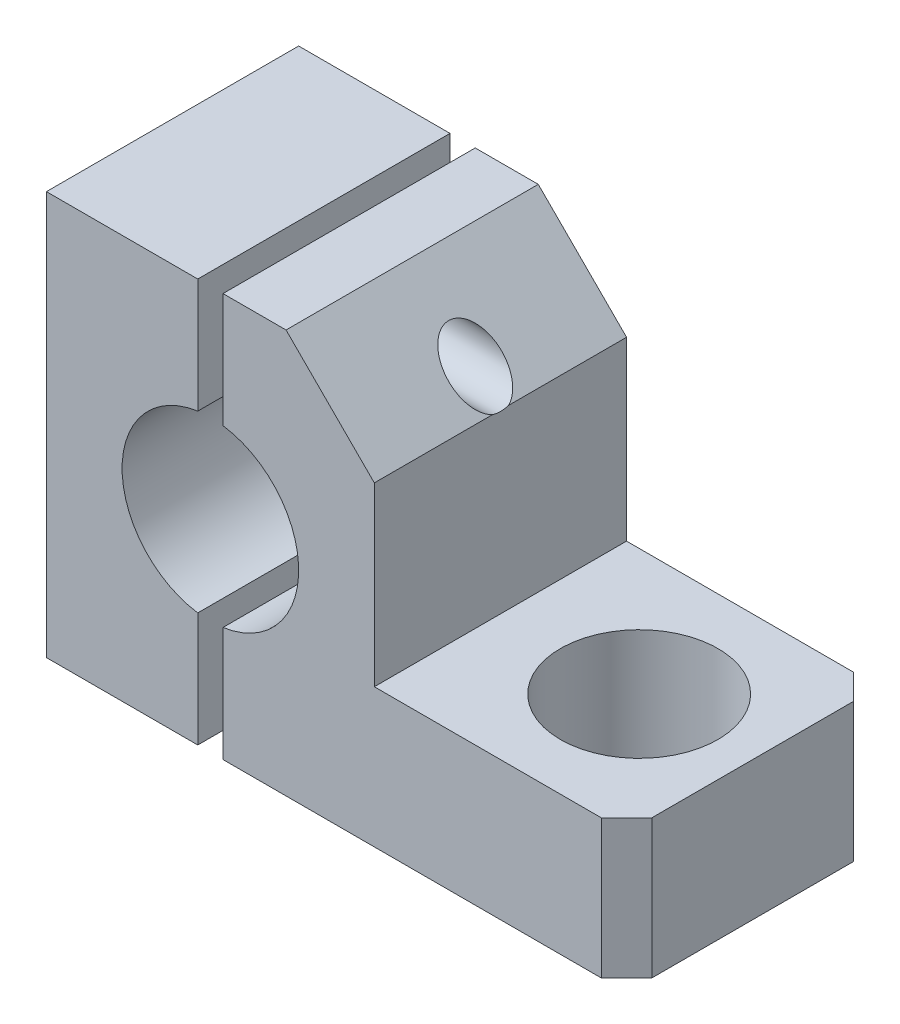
ISO-10303-21;
HEADER;
FILE_DESCRIPTION(('STEP AP214'),'2;1');
FILE_NAME('part.step','',(''),(''),'','','');
FILE_SCHEMA(('AUTOMOTIVE_DESIGN { 1 0 10303 214 1 1 1 1 }'));
ENDSEC;
DATA;
#1=APPLICATION_CONTEXT('core data for automotive mechanical design processes');
#2=APPLICATION_PROTOCOL_DEFINITION('international standard','automotive_design',2000,#1);
#3=PRODUCT_CONTEXT('',#1,'mechanical');
#4=PRODUCT('Part','Part','',(#3));
#5=PRODUCT_RELATED_PRODUCT_CATEGORY('part','',(#4));
#6=PRODUCT_DEFINITION_FORMATION('','',#4);
#7=PRODUCT_DEFINITION_CONTEXT('part definition',#1,'design');
#8=PRODUCT_DEFINITION('design','',#6,#7);
#9=PRODUCT_DEFINITION_SHAPE('','',#8);
#10=(LENGTH_UNIT() NAMED_UNIT(*) SI_UNIT(.MILLI.,.METRE.));
#11=(NAMED_UNIT(*) PLANE_ANGLE_UNIT() SI_UNIT($,.RADIAN.));
#12=(NAMED_UNIT(*) SI_UNIT($,.STERADIAN.) SOLID_ANGLE_UNIT());
#13=UNCERTAINTY_MEASURE_WITH_UNIT(LENGTH_MEASURE(1.E-05),#10,'distance_accuracy_value','');
#14=(GEOMETRIC_REPRESENTATION_CONTEXT(3) GLOBAL_UNCERTAINTY_ASSIGNED_CONTEXT((#13)) GLOBAL_UNIT_ASSIGNED_CONTEXT((#10,
#11,#12)) REPRESENTATION_CONTEXT('',''));
#15=CARTESIAN_POINT('',(0.,0.,0.));
#16=DIRECTION('',(0.,0.,1.));
#17=DIRECTION('',(1.,0.,0.));
#18=AXIS2_PLACEMENT_3D('',#15,#16,#17);
#19=CARTESIAN_POINT('',(15.0000000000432,-11.,0.));
#20=DIRECTION('',(-1.,0.,0.));
#21=DIRECTION('',(0.,0.,1.));
#22=AXIS2_PLACEMENT_3D('',#19,#20,#21);
#23=CONICAL_SURFACE('',#22,2.09999999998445,1.04719755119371);
#24=CARTESIAN_POINT('',(16.2124355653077,-11.,0.));
#25=VERTEX_POINT('',#24);
#26=VERTEX_LOOP('',#25);
#27=FACE_BOUND('',#26,.T.);
#28=CARTESIAN_POINT('',(15.,-11.,0.));
#29=DIRECTION('',(-1.,0.,0.));
#30=DIRECTION('',(0.,0.,1.));
#31=AXIS2_PLACEMENT_3D('',#28,#29,#30);
#32=CIRCLE('',#31,2.09999999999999);
#33=CARTESIAN_POINT('',(15.,-11.,2.09999999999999));
#34=VERTEX_POINT('',#33);
#35=EDGE_CURVE('P0_E121',#34,#34,#32,.T.);
#36=ORIENTED_EDGE('',*,*,#35,.T.);
#37=EDGE_LOOP('',(#36));
#38=FACE_BOUND('',#37,.T.);
#39=ADVANCED_FACE('P0_F16',(#27,#38),#23,.F.);
#40=CARTESIAN_POINT('',(1.,11.,0.));
#41=DIRECTION('',(-1.,0.,0.));
#42=DIRECTION('',(0.,0.,1.));
#43=AXIS2_PLACEMENT_3D('',#40,#41,#42);
#44=CYLINDRICAL_SURFACE('',#43,2.09999999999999);
#45=CARTESIAN_POINT('',(0.999999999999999,11.,0.));
#46=DIRECTION('',(-1.,0.,0.));
#47=DIRECTION('',(0.,0.,1.));
#48=AXIS2_PLACEMENT_3D('',#45,#46,#47);
#49=CIRCLE('',#48,2.09999999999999);
#50=CARTESIAN_POINT('',(0.999999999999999,11.,2.09999999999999));
#51=VERTEX_POINT('',#50);
#52=EDGE_CURVE('P0_E141',#51,#51,#49,.T.);
#53=ORIENTED_EDGE('',*,*,#52,.T.);
#54=EDGE_LOOP('',(#53));
#55=FACE_BOUND('',#54,.T.);
#56=CARTESIAN_POINT('',(11.,11.,0.));
#57=DIRECTION('',(-0.707106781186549,-0.707106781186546,0.));
#58=DIRECTION('',(-0.707106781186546,0.707106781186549,0.));
#59=AXIS2_PLACEMENT_3D('',#56,#57,#58);
#60=ELLIPSE('',#59,2.96984848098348,2.09999999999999);
#61=CARTESIAN_POINT('',(13.,8.99999999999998,-0.640312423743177));
#62=VERTEX_POINT('',#61);
#63=CARTESIAN_POINT('',(13.,8.99999999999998,0.640312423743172));
#64=VERTEX_POINT('',#63);
#65=EDGE_CURVE('P0_E105',#62,#64,#60,.F.);
#66=ORIENTED_EDGE('',*,*,#65,.T.);
#67=CARTESIAN_POINT('',(13.,11.,0.));
#68=DIRECTION('',(-1.,0.,0.));
#69=DIRECTION('',(0.,0.,1.));
#70=AXIS2_PLACEMENT_3D('',#67,#68,#69);
#71=CIRCLE('',#70,2.09999999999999);
#72=EDGE_CURVE('P0_E19',#62,#64,#71,.T.);
#73=ORIENTED_EDGE('',*,*,#72,.F.);
#74=EDGE_LOOP('',(#66,#73));
#75=FACE_BOUND('',#74,.T.);
#76=ADVANCED_FACE('P0_F106',(#55,#75),#44,.F.);
#77=CARTESIAN_POINT('',(1.,-11.,0.));
#78=DIRECTION('',(-1.,0.,0.));
#79=DIRECTION('',(0.,0.,1.));
#80=AXIS2_PLACEMENT_3D('',#77,#78,#79);
#81=CYLINDRICAL_SURFACE('',#80,2.09999999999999);
#82=ORIENTED_EDGE('',*,*,#35,.F.);
#83=EDGE_LOOP('',(#82));
#84=FACE_BOUND('',#83,.T.);
#85=CARTESIAN_POINT('',(1.,-11.,0.));
#86=DIRECTION('',(-1.,0.,0.));
#87=DIRECTION('',(0.,0.,1.));
#88=AXIS2_PLACEMENT_3D('',#85,#86,#87);
#89=CIRCLE('',#88,2.09999999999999);
#90=CARTESIAN_POINT('',(1.,-11.,2.09999999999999));
#91=VERTEX_POINT('',#90);
#92=EDGE_CURVE('P0_E155',#91,#91,#89,.T.);
#93=ORIENTED_EDGE('',*,*,#92,.T.);
#94=EDGE_LOOP('',(#93));
#95=FACE_BOUND('',#94,.T.);
#96=ADVANCED_FACE('P0_F351',(#84,#95),#81,.F.);
#97=CARTESIAN_POINT('',(13.,-5.,10.));
#98=DIRECTION('',(0.,-1.,0.));
#99=DIRECTION('',(0.,0.,-1.));
#100=AXIS2_PLACEMENT_3D('',#97,#98,#99);
#101=PLANE('',#100);
#102=DIRECTION('',(-0.707106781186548,0.,-0.707106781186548));
#103=VECTOR('',#102,1.);
#104=CARTESIAN_POINT('',(33.,-5.,-8.));
#105=LINE('',#104,#103);
#106=CARTESIAN_POINT('',(31.,-5.,-10.));
#107=VERTEX_POINT('',#106);
#108=CARTESIAN_POINT('',(33.,-5.,-7.99999999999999));
#109=VERTEX_POINT('',#108);
#110=EDGE_CURVE('P0_E431',#107,#109,#105,.F.);
#111=ORIENTED_EDGE('',*,*,#110,.F.);
#112=DIRECTION('',(-1.,0.,0.));
#113=VECTOR('',#112,1.);
#114=CARTESIAN_POINT('',(-13.,-5.,-10.));
#115=LINE('',#114,#113);
#116=CARTESIAN_POINT('',(13.,-5.,-10.));
#117=VERTEX_POINT('',#116);
#118=EDGE_CURVE('P0_E434',#117,#107,#115,.F.);
#119=ORIENTED_EDGE('',*,*,#118,.F.);
#120=DIRECTION('',(0.,0.,1.));
#121=VECTOR('',#120,1.);
#122=CARTESIAN_POINT('',(13.,-5.,10.));
#123=LINE('',#122,#121);
#124=CARTESIAN_POINT('',(13.,-5.,10.));
#125=VERTEX_POINT('',#124);
#126=EDGE_CURVE('P0_E111',#117,#125,#123,.T.);
#127=ORIENTED_EDGE('',*,*,#126,.T.);
#128=DIRECTION('',(-1.,0.,0.));
#129=VECTOR('',#128,1.);
#130=CARTESIAN_POINT('',(-13.,-5.,10.));
#131=LINE('',#130,#129);
#132=CARTESIAN_POINT('',(31.,-5.,10.));
#133=VERTEX_POINT('',#132);
#134=EDGE_CURVE('P0_E186',#125,#133,#131,.F.);
#135=ORIENTED_EDGE('',*,*,#134,.T.);
#136=DIRECTION('',(-0.707106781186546,0.,0.707106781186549));
#137=VECTOR('',#136,1.);
#138=CARTESIAN_POINT('',(31.,-5.,10.));
#139=LINE('',#138,#137);
#140=CARTESIAN_POINT('',(33.,-5.,8.));
#141=VERTEX_POINT('',#140);
#142=EDGE_CURVE('P0_E453',#133,#141,#139,.F.);
#143=ORIENTED_EDGE('',*,*,#142,.T.);
#144=DIRECTION('',(0.,0.,1.));
#145=VECTOR('',#144,1.);
#146=CARTESIAN_POINT('',(33.,-5.,10.));
#147=LINE('',#146,#145);
#148=EDGE_CURVE('P0_E436',#141,#109,#147,.F.);
#149=ORIENTED_EDGE('',*,*,#148,.T.);
#150=EDGE_LOOP('',(#111,#119,#127,#135,#143,#149));
#151=FACE_BOUND('',#150,.T.);
#152=CARTESIAN_POINT('',(24.,-5.,0.));
#153=DIRECTION('',(0.,1.,0.));
#154=DIRECTION('',(0.,0.,1.));
#155=AXIS2_PLACEMENT_3D('',#152,#153,#154);
#156=CIRCLE('',#155,6.25);
#157=CARTESIAN_POINT('',(24.,-5.,6.25));
#158=VERTEX_POINT('',#157);
#159=EDGE_CURVE('P0_E127',#158,#158,#156,.F.);
#160=ORIENTED_EDGE('',*,*,#159,.T.);
#161=EDGE_LOOP('',(#160));
#162=FACE_BOUND('',#161,.T.);
#163=ADVANCED_FACE('P0_F222',(#151,#162),#101,.F.);
#164=CARTESIAN_POINT('',(0.,0.,10.));
#165=DIRECTION('',(0.,0.,-1.));
#166=DIRECTION('',(-1.,0.,0.));
#167=AXIS2_PLACEMENT_3D('',#164,#165,#166);
#168=CYLINDRICAL_SURFACE('',#167,7.);
#169=CARTESIAN_POINT('',(0.,0.,10.));
#170=DIRECTION('',(0.,0.,-1.));
#171=DIRECTION('',(-1.,0.,0.));
#172=AXIS2_PLACEMENT_3D('',#169,#170,#171);
#173=CIRCLE('',#172,7.);
#174=CARTESIAN_POINT('',(1.,-6.92820323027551,10.));
#175=VERTEX_POINT('',#174);
#176=CARTESIAN_POINT('',(1.,6.92820323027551,10.));
#177=VERTEX_POINT('',#176);
#178=EDGE_CURVE('P0_E199',#175,#177,#173,.F.);
#179=ORIENTED_EDGE('',*,*,#178,.T.);
#180=DIRECTION('',(0.,0.,1.));
#181=VECTOR('',#180,1.);
#182=CARTESIAN_POINT('',(1.,6.92820323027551,-25.));
#183=LINE('',#182,#181);
#184=CARTESIAN_POINT('',(1.,6.92820323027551,-10.));
#185=VERTEX_POINT('',#184);
#186=EDGE_CURVE('P0_E138',#177,#185,#183,.F.);
#187=ORIENTED_EDGE('',*,*,#186,.T.);
#188=CARTESIAN_POINT('',(0.,0.,-10.));
#189=DIRECTION('',(0.,0.,-1.));
#190=DIRECTION('',(-1.,0.,0.));
#191=AXIS2_PLACEMENT_3D('',#188,#189,#190);
#192=CIRCLE('',#191,7.);
#193=CARTESIAN_POINT('',(1.,-6.92820323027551,-10.));
#194=VERTEX_POINT('',#193);
#195=EDGE_CURVE('P0_E196',#194,#185,#192,.F.);
#196=ORIENTED_EDGE('',*,*,#195,.F.);
#197=DIRECTION('',(0.,0.,1.));
#198=VECTOR('',#197,1.);
#199=CARTESIAN_POINT('',(1.,-6.92820323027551,-25.));
#200=LINE('',#199,#198);
#201=EDGE_CURVE('P0_E152',#194,#175,#200,.T.);
#202=ORIENTED_EDGE('',*,*,#201,.T.);
#203=EDGE_LOOP('',(#179,#187,#196,#202));
#204=FACE_BOUND('',#203,.T.);
#205=ADVANCED_FACE('P0_F212',(#204),#168,.F.);
#206=CARTESIAN_POINT('',(1.,16.,-25.));
#207=DIRECTION('',(1.,0.,0.));
#208=DIRECTION('',(0.,1.,0.));
#209=AXIS2_PLACEMENT_3D('',#206,#207,#208);
#210=PLANE('',#209);
#211=DIRECTION('',(0.,1.,0.));
#212=VECTOR('',#211,1.);
#213=CARTESIAN_POINT('',(1.,16.,-10.));
#214=LINE('',#213,#212);
#215=CARTESIAN_POINT('',(1.,16.,-10.));
#216=VERTEX_POINT('',#215);
#217=EDGE_CURVE('P0_E149',#185,#216,#214,.T.);
#218=ORIENTED_EDGE('',*,*,#217,.F.);
#219=ORIENTED_EDGE('',*,*,#186,.F.);
#220=DIRECTION('',(0.,1.,0.));
#221=VECTOR('',#220,1.);
#222=CARTESIAN_POINT('',(1.,16.,10.));
#223=LINE('',#222,#221);
#224=CARTESIAN_POINT('',(1.,16.,10.));
#225=VERTEX_POINT('',#224);
#226=EDGE_CURVE('P0_E168',#177,#225,#223,.T.);
#227=ORIENTED_EDGE('',*,*,#226,.T.);
#228=DIRECTION('',(0.,0.,-1.));
#229=VECTOR('',#228,1.);
#230=CARTESIAN_POINT('',(1.,16.,10.));
#231=LINE('',#230,#229);
#232=EDGE_CURVE('P0_E137',#225,#216,#231,.T.);
#233=ORIENTED_EDGE('',*,*,#232,.T.);
#234=EDGE_LOOP('',(#218,#219,#227,#233));
#235=FACE_BOUND('',#234,.T.);
#236=ORIENTED_EDGE('',*,*,#52,.F.);
#237=EDGE_LOOP('',(#236));
#238=FACE_BOUND('',#237,.T.);
#239=ADVANCED_FACE('P0_F209',(#235,#238),#210,.F.);
#240=CARTESIAN_POINT('',(-13.,16.,10.));
#241=DIRECTION('',(0.,-1.,0.));
#242=DIRECTION('',(0.,0.,-1.));
#243=AXIS2_PLACEMENT_3D('',#240,#241,#242);
#244=PLANE('',#243);
#245=DIRECTION('',(0.,0.,1.));
#246=VECTOR('',#245,1.);
#247=CARTESIAN_POINT('',(6.00000000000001,16.,10.));
#248=LINE('',#247,#246);
#249=CARTESIAN_POINT('',(6.00000000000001,16.,10.));
#250=VERTEX_POINT('',#249);
#251=CARTESIAN_POINT('',(6.00000000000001,16.,-10.));
#252=VERTEX_POINT('',#251);
#253=EDGE_CURVE('P0_E112',#250,#252,#248,.F.);
#254=ORIENTED_EDGE('',*,*,#253,.T.);
#255=DIRECTION('',(-1.,0.,0.));
#256=VECTOR('',#255,1.);
#257=CARTESIAN_POINT('',(-13.,16.,-10.));
#258=LINE('',#257,#256);
#259=EDGE_CURVE('P0_E146',#216,#252,#258,.F.);
#260=ORIENTED_EDGE('',*,*,#259,.F.);
#261=ORIENTED_EDGE('',*,*,#232,.F.);
#262=DIRECTION('',(-1.,0.,0.));
#263=VECTOR('',#262,1.);
#264=CARTESIAN_POINT('',(-13.,16.,10.));
#265=LINE('',#264,#263);
#266=EDGE_CURVE('P0_E165',#225,#250,#265,.F.);
#267=ORIENTED_EDGE('',*,*,#266,.T.);
#268=EDGE_LOOP('',(#254,#260,#261,#267));
#269=FACE_BOUND('',#268,.T.);
#270=ADVANCED_FACE('P0_F211',(#269),#244,.F.);
#271=CARTESIAN_POINT('',(6.00000000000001,16.,10.));
#272=DIRECTION('',(-0.707106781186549,-0.707106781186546,0.));
#273=DIRECTION('',(0.707106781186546,-0.707106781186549,0.));
#274=AXIS2_PLACEMENT_3D('',#271,#272,#273);
#275=PLANE('',#274);
#276=DIRECTION('',(0.,0.,1.));
#277=VECTOR('',#276,1.);
#278=CARTESIAN_POINT('',(13.,8.99999999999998,10.));
#279=LINE('',#278,#277);
#280=CARTESIAN_POINT('',(13.,8.99999999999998,-10.));
#281=VERTEX_POINT('',#280);
#282=EDGE_CURVE('P0_E120',#62,#281,#279,.F.);
#283=ORIENTED_EDGE('',*,*,#282,.T.);
#284=DIRECTION('',(0.707106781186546,-0.707106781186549,0.));
#285=VECTOR('',#284,1.);
#286=CARTESIAN_POINT('',(6.00000000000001,16.,-10.));
#287=LINE('',#286,#285);
#288=EDGE_CURVE('P0_E148',#252,#281,#287,.T.);
#289=ORIENTED_EDGE('',*,*,#288,.F.);
#290=ORIENTED_EDGE('',*,*,#253,.F.);
#291=DIRECTION('',(0.707106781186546,-0.707106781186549,0.));
#292=VECTOR('',#291,1.);
#293=CARTESIAN_POINT('',(6.00000000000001,16.,10.));
#294=LINE('',#293,#292);
#295=CARTESIAN_POINT('',(13.,8.99999999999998,10.));
#296=VERTEX_POINT('',#295);
#297=EDGE_CURVE('P0_E125',#250,#296,#294,.T.);
#298=ORIENTED_EDGE('',*,*,#297,.T.);
#299=DIRECTION('',(0.,0.,1.));
#300=VECTOR('',#299,1.);
#301=CARTESIAN_POINT('',(13.,8.99999999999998,10.));
#302=LINE('',#301,#300);
#303=EDGE_CURVE('P0_E117',#296,#64,#302,.F.);
#304=ORIENTED_EDGE('',*,*,#303,.T.);
#305=ORIENTED_EDGE('',*,*,#65,.F.);
#306=EDGE_LOOP('',(#283,#289,#290,#298,#304,#305));
#307=FACE_BOUND('',#306,.T.);
#308=ADVANCED_FACE('P0_F123',(#307),#275,.F.);
#309=CARTESIAN_POINT('',(13.,16.,10.));
#310=DIRECTION('',(-1.,0.,0.));
#311=DIRECTION('',(0.,-1.,0.));
#312=AXIS2_PLACEMENT_3D('',#309,#310,#311);
#313=PLANE('',#312);
#314=ORIENTED_EDGE('',*,*,#72,.T.);
#315=ORIENTED_EDGE('',*,*,#303,.F.);
#316=DIRECTION('',(0.,1.,0.));
#317=VECTOR('',#316,1.);
#318=CARTESIAN_POINT('',(13.,16.,10.));
#319=LINE('',#318,#317);
#320=EDGE_CURVE('P0_E184',#296,#125,#319,.F.);
#321=ORIENTED_EDGE('',*,*,#320,.T.);
#322=ORIENTED_EDGE('',*,*,#126,.F.);
#323=DIRECTION('',(0.,1.,0.));
#324=VECTOR('',#323,1.);
#325=CARTESIAN_POINT('',(13.,16.,-10.));
#326=LINE('',#325,#324);
#327=EDGE_CURVE('P0_E177',#281,#117,#326,.F.);
#328=ORIENTED_EDGE('',*,*,#327,.F.);
#329=ORIENTED_EDGE('',*,*,#282,.F.);
#330=EDGE_LOOP('',(#314,#315,#321,#322,#328,#329));
#331=FACE_BOUND('',#330,.T.);
#332=ADVANCED_FACE('P0_F115',(#331),#313,.F.);
#333=CARTESIAN_POINT('',(24.,-16.,0.));
#334=DIRECTION('',(0.,1.,0.));
#335=DIRECTION('',(0.,0.,1.));
#336=AXIS2_PLACEMENT_3D('',#333,#334,#335);
#337=CYLINDRICAL_SURFACE('',#336,6.25);
#338=CARTESIAN_POINT('',(24.,-16.,0.));
#339=DIRECTION('',(0.,1.,0.));
#340=DIRECTION('',(0.,0.,1.));
#341=AXIS2_PLACEMENT_3D('',#338,#339,#340);
#342=CIRCLE('',#341,6.25);
#343=CARTESIAN_POINT('',(24.,-16.,6.25));
#344=VERTEX_POINT('',#343);
#345=EDGE_CURVE('P0_E160',#344,#344,#342,.F.);
#346=ORIENTED_EDGE('',*,*,#345,.T.);
#347=EDGE_LOOP('',(#346));
#348=FACE_BOUND('',#347,.T.);
#349=ORIENTED_EDGE('',*,*,#159,.F.);
#350=EDGE_LOOP('',(#349));
#351=FACE_BOUND('',#350,.T.);
#352=ADVANCED_FACE('P0_F257',(#348,#351),#337,.F.);
#353=CARTESIAN_POINT('',(1.,16.,-25.));
#354=DIRECTION('',(1.,0.,0.));
#355=DIRECTION('',(0.,1.,0.));
#356=AXIS2_PLACEMENT_3D('',#353,#354,#355);
#357=PLANE('',#356);
#358=DIRECTION('',(0.,1.,0.));
#359=VECTOR('',#358,1.);
#360=CARTESIAN_POINT('',(1.,16.,-10.));
#361=LINE('',#360,#359);
#362=CARTESIAN_POINT('',(1.,-16.,-10.));
#363=VERTEX_POINT('',#362);
#364=EDGE_CURVE('P0_E198',#363,#194,#361,.T.);
#365=ORIENTED_EDGE('',*,*,#364,.F.);
#366=DIRECTION('',(0.,0.,1.));
#367=VECTOR('',#366,1.);
#368=CARTESIAN_POINT('',(1.,-16.,10.));
#369=LINE('',#368,#367);
#370=CARTESIAN_POINT('',(1.,-16.,10.));
#371=VERTEX_POINT('',#370);
#372=EDGE_CURVE('P0_E156',#363,#371,#369,.T.);
#373=ORIENTED_EDGE('',*,*,#372,.T.);
#374=DIRECTION('',(0.,1.,0.));
#375=VECTOR('',#374,1.);
#376=CARTESIAN_POINT('',(1.,16.,10.));
#377=LINE('',#376,#375);
#378=EDGE_CURVE('P0_E154',#371,#175,#377,.T.);
#379=ORIENTED_EDGE('',*,*,#378,.T.);
#380=ORIENTED_EDGE('',*,*,#201,.F.);
#381=EDGE_LOOP('',(#365,#373,#379,#380));
#382=FACE_BOUND('',#381,.T.);
#383=ORIENTED_EDGE('',*,*,#92,.F.);
#384=EDGE_LOOP('',(#383));
#385=FACE_BOUND('',#384,.T.);
#386=ADVANCED_FACE('P0_F253',(#382,#385),#357,.F.);
#387=CARTESIAN_POINT('',(-13.,16.,10.));
#388=DIRECTION('',(0.,0.,-1.));
#389=DIRECTION('',(-1.,0.,0.));
#390=AXIS2_PLACEMENT_3D('',#387,#388,#389);
#391=PLANE('',#390);
#392=DIRECTION('',(0.,1.,0.));
#393=VECTOR('',#392,1.);
#394=CARTESIAN_POINT('',(31.,16.,10.));
#395=LINE('',#394,#393);
#396=CARTESIAN_POINT('',(31.,-16.,10.));
#397=VERTEX_POINT('',#396);
#398=EDGE_CURVE('P0_E455',#397,#133,#395,.T.);
#399=ORIENTED_EDGE('',*,*,#398,.T.);
#400=ORIENTED_EDGE('',*,*,#134,.F.);
#401=ORIENTED_EDGE('',*,*,#320,.F.);
#402=ORIENTED_EDGE('',*,*,#297,.F.);
#403=ORIENTED_EDGE('',*,*,#266,.F.);
#404=ORIENTED_EDGE('',*,*,#226,.F.);
#405=ORIENTED_EDGE('',*,*,#178,.F.);
#406=ORIENTED_EDGE('',*,*,#378,.F.);
#407=DIRECTION('',(-1.,0.,0.));
#408=VECTOR('',#407,1.);
#409=CARTESIAN_POINT('',(33.,-16.,10.));
#410=LINE('',#409,#408);
#411=EDGE_CURVE('P0_E159',#371,#397,#410,.F.);
#412=ORIENTED_EDGE('',*,*,#411,.T.);
#413=EDGE_LOOP('',(#399,#400,#401,#402,#403,#404,#405,#406,#412));
#414=FACE_BOUND('',#413,.T.);
#415=ADVANCED_FACE('P0_F249',(#414),#391,.F.);
#416=CARTESIAN_POINT('',(31.,16.,10.));
#417=DIRECTION('',(-0.707106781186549,0.,-0.707106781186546));
#418=DIRECTION('',(-0.707106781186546,0.,0.707106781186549));
#419=AXIS2_PLACEMENT_3D('',#416,#417,#418);
#420=PLANE('',#419);
#421=DIRECTION('',(0.,1.,0.));
#422=VECTOR('',#421,1.);
#423=CARTESIAN_POINT('',(33.,-5.,8.));
#424=LINE('',#423,#422);
#425=CARTESIAN_POINT('',(33.,-16.,8.));
#426=VERTEX_POINT('',#425);
#427=EDGE_CURVE('P0_E450',#426,#141,#424,.T.);
#428=ORIENTED_EDGE('',*,*,#427,.T.);
#429=ORIENTED_EDGE('',*,*,#142,.F.);
#430=ORIENTED_EDGE('',*,*,#398,.F.);
#431=DIRECTION('',(0.707106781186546,0.,-0.707106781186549));
#432=VECTOR('',#431,1.);
#433=CARTESIAN_POINT('',(31.,-16.,10.));
#434=LINE('',#433,#432);
#435=EDGE_CURVE('P0_E173',#397,#426,#434,.T.);
#436=ORIENTED_EDGE('',*,*,#435,.T.);
#437=EDGE_LOOP('',(#428,#429,#430,#436));
#438=FACE_BOUND('',#437,.T.);
#439=ADVANCED_FACE('P0_F245',(#438),#420,.F.);
#440=CARTESIAN_POINT('',(33.,-5.,10.));
#441=DIRECTION('',(-1.,0.,0.));
#442=DIRECTION('',(0.,0.,1.));
#443=AXIS2_PLACEMENT_3D('',#440,#441,#442);
#444=PLANE('',#443);
#445=DIRECTION('',(0.,1.,0.));
#446=VECTOR('',#445,1.);
#447=CARTESIAN_POINT('',(33.,-5.,-8.));
#448=LINE('',#447,#446);
#449=CARTESIAN_POINT('',(33.,-16.,-8.));
#450=VERTEX_POINT('',#449);
#451=EDGE_CURVE('P0_E438',#109,#450,#448,.F.);
#452=ORIENTED_EDGE('',*,*,#451,.F.);
#453=ORIENTED_EDGE('',*,*,#148,.F.);
#454=ORIENTED_EDGE('',*,*,#427,.F.);
#455=DIRECTION('',(0.,0.,1.));
#456=VECTOR('',#455,1.);
#457=CARTESIAN_POINT('',(33.,-16.,10.));
#458=LINE('',#457,#456);
#459=EDGE_CURVE('P0_E474',#426,#450,#458,.F.);
#460=ORIENTED_EDGE('',*,*,#459,.T.);
#461=EDGE_LOOP('',(#452,#453,#454,#460));
#462=FACE_BOUND('',#461,.T.);
#463=ADVANCED_FACE('P0_F241',(#462),#444,.F.);
#464=CARTESIAN_POINT('',(33.,-5.,-8.));
#465=DIRECTION('',(0.707106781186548,0.,-0.707106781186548));
#466=DIRECTION('',(-0.707106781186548,0.,-0.707106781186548));
#467=AXIS2_PLACEMENT_3D('',#464,#465,#466);
#468=PLANE('',#467);
#469=ORIENTED_EDGE('',*,*,#110,.T.);
#470=ORIENTED_EDGE('',*,*,#451,.T.);
#471=DIRECTION('',(-0.707106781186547,0.,-0.707106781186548));
#472=VECTOR('',#471,1.);
#473=CARTESIAN_POINT('',(33.,-16.,-7.99999999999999));
#474=LINE('',#473,#472);
#475=CARTESIAN_POINT('',(31.,-16.,-10.));
#476=VERTEX_POINT('',#475);
#477=EDGE_CURVE('P0_E25',#450,#476,#474,.T.);
#478=ORIENTED_EDGE('',*,*,#477,.T.);
#479=DIRECTION('',(0.,1.,0.));
#480=VECTOR('',#479,1.);
#481=CARTESIAN_POINT('',(31.,16.,-10.));
#482=LINE('',#481,#480);
#483=EDGE_CURVE('P0_E33',#107,#476,#482,.F.);
#484=ORIENTED_EDGE('',*,*,#483,.F.);
#485=EDGE_LOOP('',(#469,#470,#478,#484));
#486=FACE_BOUND('',#485,.T.);
#487=ADVANCED_FACE('P0_F234',(#486),#468,.T.);
#488=CARTESIAN_POINT('',(-13.,16.,-10.));
#489=DIRECTION('',(0.,0.,-1.));
#490=DIRECTION('',(-1.,0.,0.));
#491=AXIS2_PLACEMENT_3D('',#488,#489,#490);
#492=PLANE('',#491);
#493=ORIENTED_EDGE('',*,*,#288,.T.);
#494=ORIENTED_EDGE('',*,*,#327,.T.);
#495=ORIENTED_EDGE('',*,*,#118,.T.);
#496=ORIENTED_EDGE('',*,*,#483,.T.);
#497=DIRECTION('',(-1.,0.,0.));
#498=VECTOR('',#497,1.);
#499=CARTESIAN_POINT('',(33.,-16.,-10.));
#500=LINE('',#499,#498);
#501=EDGE_CURVE('P0_E11',#476,#363,#500,.T.);
#502=ORIENTED_EDGE('',*,*,#501,.T.);
#503=ORIENTED_EDGE('',*,*,#364,.T.);
#504=ORIENTED_EDGE('',*,*,#195,.T.);
#505=ORIENTED_EDGE('',*,*,#217,.T.);
#506=ORIENTED_EDGE('',*,*,#259,.T.);
#507=EDGE_LOOP('',(#493,#494,#495,#496,#502,#503,#504,#505,#506));
#508=FACE_BOUND('',#507,.T.);
#509=ADVANCED_FACE('P0_F228',(#508),#492,.T.);
#510=CARTESIAN_POINT('',(33.,-16.,10.));
#511=DIRECTION('',(0.,1.,0.));
#512=DIRECTION('',(-1.,0.,0.));
#513=AXIS2_PLACEMENT_3D('',#510,#511,#512);
#514=PLANE('',#513);
#515=ORIENTED_EDGE('',*,*,#477,.F.);
#516=ORIENTED_EDGE('',*,*,#459,.F.);
#517=ORIENTED_EDGE('',*,*,#435,.F.);
#518=ORIENTED_EDGE('',*,*,#411,.F.);
#519=ORIENTED_EDGE('',*,*,#372,.F.);
#520=ORIENTED_EDGE('',*,*,#501,.F.);
#521=EDGE_LOOP('',(#515,#516,#517,#518,#519,#520));
#522=FACE_BOUND('',#521,.T.);
#523=ORIENTED_EDGE('',*,*,#345,.F.);
#524=EDGE_LOOP('',(#523));
#525=FACE_BOUND('',#524,.T.);
#526=ADVANCED_FACE('P0_F226',(#522,#525),#514,.F.);
#527=CLOSED_SHELL('',(#39,#76,#96,#163,#205,#239,#270,#308,#332,#352,#386,#415,#439,#463,#487,
#509,#526));
#528=MANIFOLD_SOLID_BREP('P0_B1',#527);
#529=CARTESIAN_POINT('',(-0.999999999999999,16.,-25.));
#530=DIRECTION('',(-1.,0.,0.));
#531=DIRECTION('',(0.,-1.,0.));
#532=AXIS2_PLACEMENT_3D('',#529,#530,#531);
#533=PLANE('',#532);
#534=DIRECTION('',(0.,1.,0.));
#535=VECTOR('',#534,1.);
#536=CARTESIAN_POINT('',(-0.999999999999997,16.,-10.));
#537=LINE('',#536,#535);
#538=CARTESIAN_POINT('',(-0.999999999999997,-6.92820323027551,-10.));
#539=VERTEX_POINT('',#538);
#540=CARTESIAN_POINT('',(-0.999999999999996,-16.,-10.));
#541=VERTEX_POINT('',#540);
#542=EDGE_CURVE('P1_E124',#539,#541,#537,.F.);
#543=ORIENTED_EDGE('',*,*,#542,.F.);
#544=DIRECTION('',(0.,0.,-1.));
#545=VECTOR('',#544,1.);
#546=CARTESIAN_POINT('',(-0.999999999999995,-6.92820323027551,10.));
#547=LINE('',#546,#545);
#548=CARTESIAN_POINT('',(-0.999999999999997,-6.92820323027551,10.));
#549=VERTEX_POINT('',#548);
#550=EDGE_CURVE('P1_E64',#539,#549,#547,.F.);
#551=ORIENTED_EDGE('',*,*,#550,.T.);
#552=DIRECTION('',(0.,1.,0.));
#553=VECTOR('',#552,1.);
#554=CARTESIAN_POINT('',(-0.999999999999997,16.,10.));
#555=LINE('',#554,#553);
#556=CARTESIAN_POINT('',(-0.999999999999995,-16.,10.));
#557=VERTEX_POINT('',#556);
#558=EDGE_CURVE('P1_E77',#549,#557,#555,.F.);
#559=ORIENTED_EDGE('',*,*,#558,.T.);
#560=DIRECTION('',(0.,0.,1.));
#561=VECTOR('',#560,1.);
#562=CARTESIAN_POINT('',(-0.999999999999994,-16.,10.));
#563=LINE('',#562,#561);
#564=EDGE_CURVE('P1_E121',#557,#541,#563,.F.);
#565=ORIENTED_EDGE('',*,*,#564,.T.);
#566=EDGE_LOOP('',(#543,#551,#559,#565));
#567=FACE_BOUND('',#566,.T.);
#568=CARTESIAN_POINT('',(-0.999999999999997,-11.,0.));
#569=DIRECTION('',(-1.,0.,0.));
#570=DIRECTION('',(0.,0.,1.));
#571=AXIS2_PLACEMENT_3D('',#568,#569,#570);
#572=CIRCLE('',#571,2.75);
#573=CARTESIAN_POINT('',(-0.999999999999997,-11.,2.75));
#574=VERTEX_POINT('',#573);
#575=EDGE_CURVE('P1_E19',#574,#574,#572,.T.);
#576=ORIENTED_EDGE('',*,*,#575,.T.);
#577=EDGE_LOOP('',(#576));
#578=FACE_BOUND('',#577,.T.);
#579=ADVANCED_FACE('P1_F16',(#567,#578),#533,.F.);
#580=CARTESIAN_POINT('',(-0.999999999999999,16.,-25.));
#581=DIRECTION('',(-1.,0.,0.));
#582=DIRECTION('',(0.,-1.,0.));
#583=AXIS2_PLACEMENT_3D('',#580,#581,#582);
#584=PLANE('',#583);
#585=DIRECTION('',(0.,1.,0.));
#586=VECTOR('',#585,1.);
#587=CARTESIAN_POINT('',(-0.999999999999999,16.,-10.));
#588=LINE('',#587,#586);
#589=CARTESIAN_POINT('',(-0.999999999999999,16.,-10.));
#590=VERTEX_POINT('',#589);
#591=CARTESIAN_POINT('',(-0.999999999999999,6.92820323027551,-10.));
#592=VERTEX_POINT('',#591);
#593=EDGE_CURVE('P1_E105',#590,#592,#588,.F.);
#594=ORIENTED_EDGE('',*,*,#593,.F.);
#595=DIRECTION('',(0.,0.,-1.));
#596=VECTOR('',#595,1.);
#597=CARTESIAN_POINT('',(-0.999999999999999,16.,10.));
#598=LINE('',#597,#596);
#599=CARTESIAN_POINT('',(-0.999999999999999,16.,10.));
#600=VERTEX_POINT('',#599);
#601=EDGE_CURVE('P1_E91',#590,#600,#598,.F.);
#602=ORIENTED_EDGE('',*,*,#601,.T.);
#603=DIRECTION('',(0.,1.,0.));
#604=VECTOR('',#603,1.);
#605=CARTESIAN_POINT('',(-0.999999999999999,16.,10.));
#606=LINE('',#605,#604);
#607=CARTESIAN_POINT('',(-0.999999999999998,6.92820323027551,10.));
#608=VERTEX_POINT('',#607);
#609=EDGE_CURVE('P1_E74',#600,#608,#606,.F.);
#610=ORIENTED_EDGE('',*,*,#609,.T.);
#611=DIRECTION('',(0.,0.,-1.));
#612=VECTOR('',#611,1.);
#613=CARTESIAN_POINT('',(-0.999999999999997,6.92820323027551,10.));
#614=LINE('',#613,#612);
#615=EDGE_CURVE('P1_E81',#608,#592,#614,.T.);
#616=ORIENTED_EDGE('',*,*,#615,.T.);
#617=EDGE_LOOP('',(#594,#602,#610,#616));
#618=FACE_BOUND('',#617,.T.);
#619=CARTESIAN_POINT('',(-0.999999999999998,11.,0.));
#620=DIRECTION('',(-1.,0.,0.));
#621=DIRECTION('',(0.,0.,1.));
#622=AXIS2_PLACEMENT_3D('',#619,#620,#621);
#623=CIRCLE('',#622,2.75);
#624=CARTESIAN_POINT('',(-0.999999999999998,11.,2.75));
#625=VERTEX_POINT('',#624);
#626=EDGE_CURVE('P1_E109',#625,#625,#623,.T.);
#627=ORIENTED_EDGE('',*,*,#626,.T.);
#628=EDGE_LOOP('',(#627));
#629=FACE_BOUND('',#628,.T.);
#630=ADVANCED_FACE('P1_F89',(#618,#629),#584,.F.);
#631=CARTESIAN_POINT('',(0.,0.,10.));
#632=DIRECTION('',(0.,0.,-1.));
#633=DIRECTION('',(-1.,0.,0.));
#634=AXIS2_PLACEMENT_3D('',#631,#632,#633);
#635=CYLINDRICAL_SURFACE('',#634,7.);
#636=CARTESIAN_POINT('',(0.,0.,10.));
#637=DIRECTION('',(0.,0.,-1.));
#638=DIRECTION('',(-1.,0.,0.));
#639=AXIS2_PLACEMENT_3D('',#636,#637,#638);
#640=CIRCLE('',#639,7.);
#641=EDGE_CURVE('P1_E70',#608,#549,#640,.F.);
#642=ORIENTED_EDGE('',*,*,#641,.T.);
#643=ORIENTED_EDGE('',*,*,#550,.F.);
#644=CARTESIAN_POINT('',(0.,0.,-10.));
#645=DIRECTION('',(0.,0.,-1.));
#646=DIRECTION('',(-1.,0.,0.));
#647=AXIS2_PLACEMENT_3D('',#644,#645,#646);
#648=CIRCLE('',#647,7.);
#649=EDGE_CURVE('P1_E84',#592,#539,#648,.F.);
#650=ORIENTED_EDGE('',*,*,#649,.F.);
#651=ORIENTED_EDGE('',*,*,#615,.F.);
#652=EDGE_LOOP('',(#642,#643,#650,#651));
#653=FACE_BOUND('',#652,.T.);
#654=ADVANCED_FACE('P1_F82',(#653),#635,.F.);
#655=CARTESIAN_POINT('',(6.77817459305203,-11.,0.));
#656=DIRECTION('',(-1.,0.,0.));
#657=DIRECTION('',(0.,0.,1.));
#658=AXIS2_PLACEMENT_3D('',#655,#656,#657);
#659=CYLINDRICAL_SURFACE('',#658,2.75);
#660=ORIENTED_EDGE('',*,*,#575,.F.);
#661=EDGE_LOOP('',(#660));
#662=FACE_BOUND('',#661,.T.);
#663=CARTESIAN_POINT('',(-13.,-11.,0.));
#664=DIRECTION('',(-1.,0.,0.));
#665=DIRECTION('',(0.,0.,1.));
#666=AXIS2_PLACEMENT_3D('',#663,#664,#665);
#667=CIRCLE('',#666,2.75);
#668=CARTESIAN_POINT('',(-13.,-11.,2.75));
#669=VERTEX_POINT('',#668);
#670=EDGE_CURVE('P1_E146',#669,#669,#667,.T.);
#671=ORIENTED_EDGE('',*,*,#670,.T.);
#672=EDGE_LOOP('',(#671));
#673=FACE_BOUND('',#672,.T.);
#674=ADVANCED_FACE('P1_F155',(#662,#673),#659,.F.);
#675=CARTESIAN_POINT('',(6.77817459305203,11.,0.));
#676=DIRECTION('',(-1.,0.,0.));
#677=DIRECTION('',(0.,0.,1.));
#678=AXIS2_PLACEMENT_3D('',#675,#676,#677);
#679=CYLINDRICAL_SURFACE('',#678,2.75);
#680=ORIENTED_EDGE('',*,*,#626,.F.);
#681=EDGE_LOOP('',(#680));
#682=FACE_BOUND('',#681,.T.);
#683=CARTESIAN_POINT('',(-13.,11.,0.));
#684=DIRECTION('',(-1.,0.,0.));
#685=DIRECTION('',(0.,0.,1.));
#686=AXIS2_PLACEMENT_3D('',#683,#684,#685);
#687=CIRCLE('',#686,2.75);
#688=CARTESIAN_POINT('',(-13.,11.,2.75));
#689=VERTEX_POINT('',#688);
#690=EDGE_CURVE('P1_E116',#689,#689,#687,.T.);
#691=ORIENTED_EDGE('',*,*,#690,.T.);
#692=EDGE_LOOP('',(#691));
#693=FACE_BOUND('',#692,.T.);
#694=ADVANCED_FACE('P1_F158',(#682,#693),#679,.F.);
#695=CARTESIAN_POINT('',(-13.,16.,10.));
#696=DIRECTION('',(0.,-1.,0.));
#697=DIRECTION('',(0.,0.,-1.));
#698=AXIS2_PLACEMENT_3D('',#695,#696,#697);
#699=PLANE('',#698);
#700=ORIENTED_EDGE('',*,*,#601,.F.);
#701=DIRECTION('',(-1.,0.,0.));
#702=VECTOR('',#701,1.);
#703=CARTESIAN_POINT('',(-13.,16.,-10.));
#704=LINE('',#703,#702);
#705=CARTESIAN_POINT('',(-13.,16.,-10.));
#706=VERTEX_POINT('',#705);
#707=EDGE_CURVE('P1_E102',#706,#590,#704,.F.);
#708=ORIENTED_EDGE('',*,*,#707,.F.);
#709=DIRECTION('',(0.,0.,-1.));
#710=VECTOR('',#709,1.);
#711=CARTESIAN_POINT('',(-13.,16.,10.));
#712=LINE('',#711,#710);
#713=CARTESIAN_POINT('',(-13.,16.,10.));
#714=VERTEX_POINT('',#713);
#715=EDGE_CURVE('P1_E112',#706,#714,#712,.F.);
#716=ORIENTED_EDGE('',*,*,#715,.T.);
#717=DIRECTION('',(-1.,0.,0.));
#718=VECTOR('',#717,1.);
#719=CARTESIAN_POINT('',(-13.,16.,10.));
#720=LINE('',#719,#718);
#721=EDGE_CURVE('P1_E92',#714,#600,#720,.F.);
#722=ORIENTED_EDGE('',*,*,#721,.T.);
#723=EDGE_LOOP('',(#700,#708,#716,#722));
#724=FACE_BOUND('',#723,.T.);
#725=ADVANCED_FACE('P1_F181',(#724),#699,.F.);
#726=CARTESIAN_POINT('',(-13.,16.,10.));
#727=DIRECTION('',(0.,0.,-1.));
#728=DIRECTION('',(-1.,0.,0.));
#729=AXIS2_PLACEMENT_3D('',#726,#727,#728);
#730=PLANE('',#729);
#731=ORIENTED_EDGE('',*,*,#558,.F.);
#732=ORIENTED_EDGE('',*,*,#641,.F.);
#733=ORIENTED_EDGE('',*,*,#609,.F.);
#734=ORIENTED_EDGE('',*,*,#721,.F.);
#735=DIRECTION('',(0.,1.,0.));
#736=VECTOR('',#735,1.);
#737=CARTESIAN_POINT('',(-13.,-16.,10.));
#738=LINE('',#737,#736);
#739=CARTESIAN_POINT('',(-13.,-16.,10.));
#740=VERTEX_POINT('',#739);
#741=EDGE_CURVE('P1_E115',#714,#740,#738,.F.);
#742=ORIENTED_EDGE('',*,*,#741,.T.);
#743=DIRECTION('',(-1.,0.,0.));
#744=VECTOR('',#743,1.);
#745=CARTESIAN_POINT('',(33.,-16.,10.));
#746=LINE('',#745,#744);
#747=EDGE_CURVE('P1_E125',#740,#557,#746,.F.);
#748=ORIENTED_EDGE('',*,*,#747,.T.);
#749=EDGE_LOOP('',(#731,#732,#733,#734,#742,#748));
#750=FACE_BOUND('',#749,.T.);
#751=ADVANCED_FACE('P1_F72',(#750),#730,.F.);
#752=CARTESIAN_POINT('',(33.,-16.,10.));
#753=DIRECTION('',(0.,1.,0.));
#754=DIRECTION('',(-1.,0.,0.));
#755=AXIS2_PLACEMENT_3D('',#752,#753,#754);
#756=PLANE('',#755);
#757=ORIENTED_EDGE('',*,*,#564,.F.);
#758=ORIENTED_EDGE('',*,*,#747,.F.);
#759=DIRECTION('',(0.,0.,-1.));
#760=VECTOR('',#759,1.);
#761=CARTESIAN_POINT('',(-13.,-16.,10.));
#762=LINE('',#761,#760);
#763=CARTESIAN_POINT('',(-13.,-16.,-10.));
#764=VERTEX_POINT('',#763);
#765=EDGE_CURVE('P1_E25',#740,#764,#762,.T.);
#766=ORIENTED_EDGE('',*,*,#765,.T.);
#767=DIRECTION('',(-1.,0.,0.));
#768=VECTOR('',#767,1.);
#769=CARTESIAN_POINT('',(-13.,-16.,-10.));
#770=LINE('',#769,#768);
#771=EDGE_CURVE('P1_E33',#541,#764,#770,.T.);
#772=ORIENTED_EDGE('',*,*,#771,.F.);
#773=EDGE_LOOP('',(#757,#758,#766,#772));
#774=FACE_BOUND('',#773,.T.);
#775=ADVANCED_FACE('P1_F171',(#774),#756,.F.);
#776=CARTESIAN_POINT('',(-13.,16.,-10.));
#777=DIRECTION('',(0.,0.,-1.));
#778=DIRECTION('',(-1.,0.,0.));
#779=AXIS2_PLACEMENT_3D('',#776,#777,#778);
#780=PLANE('',#779);
#781=ORIENTED_EDGE('',*,*,#593,.T.);
#782=ORIENTED_EDGE('',*,*,#649,.T.);
#783=ORIENTED_EDGE('',*,*,#542,.T.);
#784=ORIENTED_EDGE('',*,*,#771,.T.);
#785=DIRECTION('',(0.,1.,0.));
#786=VECTOR('',#785,1.);
#787=CARTESIAN_POINT('',(-13.,-16.,-10.));
#788=LINE('',#787,#786);
#789=EDGE_CURVE('P1_E11',#764,#706,#788,.T.);
#790=ORIENTED_EDGE('',*,*,#789,.T.);
#791=ORIENTED_EDGE('',*,*,#707,.T.);
#792=EDGE_LOOP('',(#781,#782,#783,#784,#790,#791));
#793=FACE_BOUND('',#792,.T.);
#794=ADVANCED_FACE('P1_F164',(#793),#780,.T.);
#795=CARTESIAN_POINT('',(-13.,-16.,10.));
#796=DIRECTION('',(1.,0.,0.));
#797=DIRECTION('',(0.,0.,-1.));
#798=AXIS2_PLACEMENT_3D('',#795,#796,#797);
#799=PLANE('',#798);
#800=ORIENTED_EDGE('',*,*,#765,.F.);
#801=ORIENTED_EDGE('',*,*,#741,.F.);
#802=ORIENTED_EDGE('',*,*,#715,.F.);
#803=ORIENTED_EDGE('',*,*,#789,.F.);
#804=EDGE_LOOP('',(#800,#801,#802,#803));
#805=FACE_BOUND('',#804,.T.);
#806=ORIENTED_EDGE('',*,*,#690,.F.);
#807=EDGE_LOOP('',(#806));
#808=FACE_BOUND('',#807,.T.);
#809=ORIENTED_EDGE('',*,*,#670,.F.);
#810=EDGE_LOOP('',(#809));
#811=FACE_BOUND('',#810,.T.);
#812=ADVANCED_FACE('P1_F162',(#805,#808,#811),#799,.F.);
#813=CLOSED_SHELL('',(#579,#630,#654,#674,#694,#725,#751,#775,#794,#812));
#814=MANIFOLD_SOLID_BREP('P1_B1',#813);
#815=ADVANCED_BREP_SHAPE_REPRESENTATION('',(#18,#528,#814),#14);
#816=SHAPE_DEFINITION_REPRESENTATION(#9,#815);
ENDSEC;
END-ISO-10303-21;
